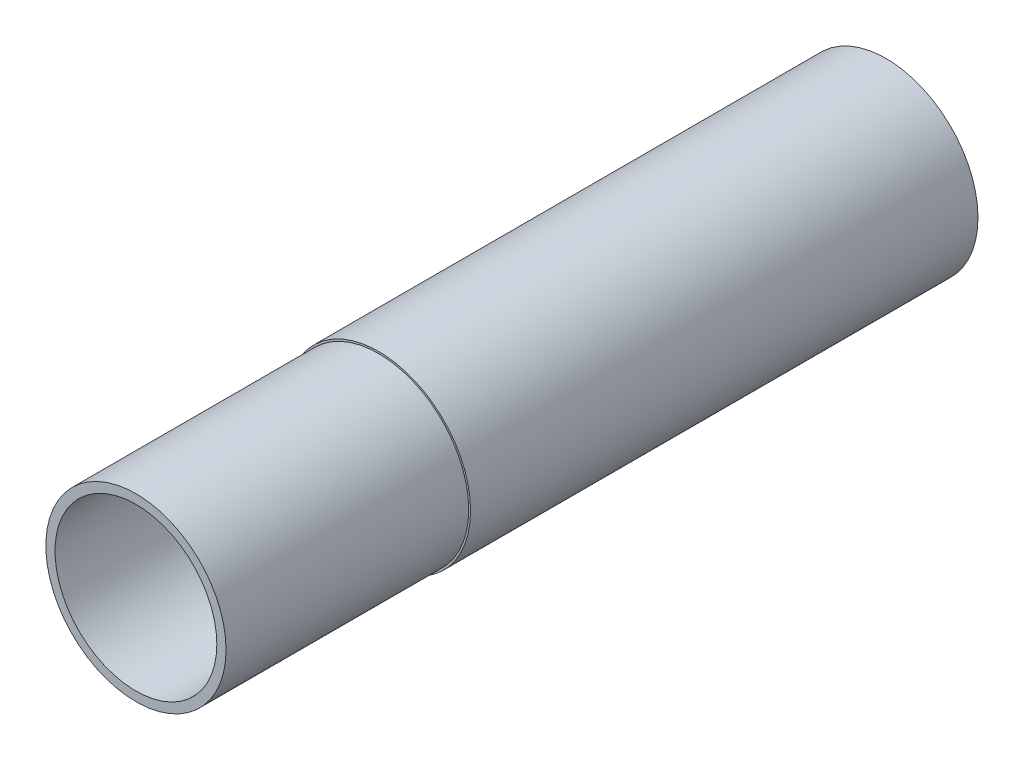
from build123d import *

# Parameters (mm, degrees)
ESQUISSE1_R             = 12.5
ESQUISSE1_R_2           = 11
BOSS_EXTRU_1_DEPTH      = 102
ENL_V_START             = -33
ESQUISSE2_R             = 12.5
ESQUISSE2_R_2           = 12.25
ENL_V_MAT_EXTRU_1_DEPTH = 33


with BuildPart() as part:
    # Esquisse1 → Boss.-Extru.1 (new body)
    with BuildSketch(Plane.XY):
        Circle(ESQUISSE1_R)
        Circle(ESQUISSE1_R_2, mode=Mode.SUBTRACT)
    extrude(amount=BOSS_EXTRU_1_DEPTH)

    # Esquisse2 → Enl_v. mat.-Extru.1 (cut)
    with BuildSketch(Plane.XY.offset(102).offset(ENL_V_START)):
        Circle(ESQUISSE2_R)
        Circle(ESQUISSE2_R_2, mode=Mode.SUBTRACT)
    extrude(amount=ENL_V_MAT_EXTRU_1_DEPTH, mode=Mode.SUBTRACT)


solid = part.part
